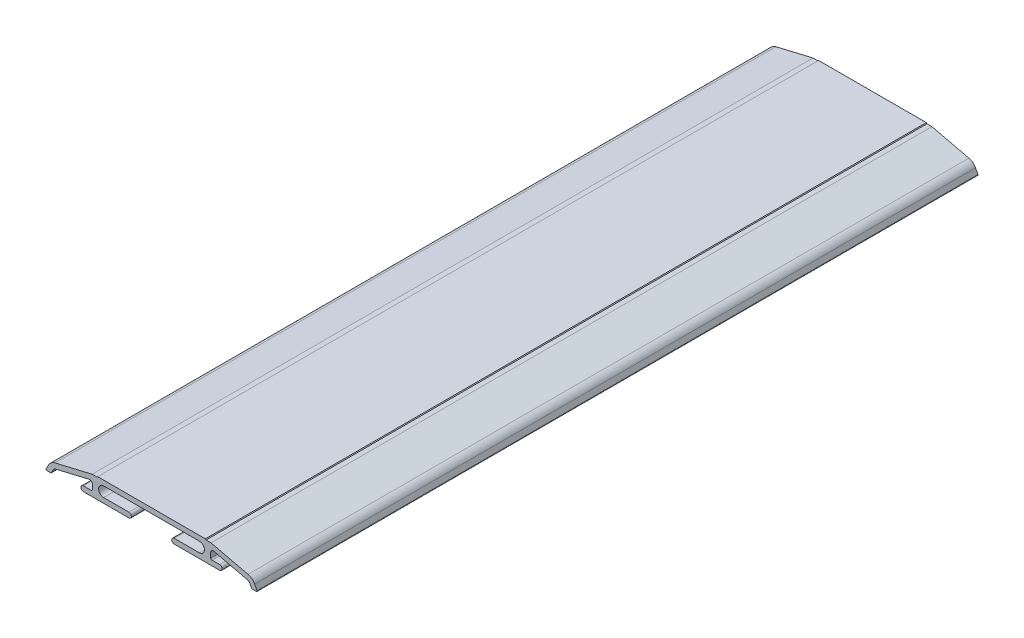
from build123d import *

# Parameters (mm, degrees)
EXTRUDE_1_DEPTH = 286


with BuildPart() as part:
    # Sketch 1 → Extrude 1 (new body)
    with BuildSketch(Plane.XY):
        with BuildLine():
            Line((41.28405549, 54.33971025), (40.342649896, 56.128604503))
            ThreePointArc((40.342649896, 56.128604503), (39.252751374, 57.427783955), (37.722527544, 58.158647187))
            Line((37.722527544, 58.158647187), (23.028357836, 61.63))
            Line((23.028357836, 61.63), (21.065453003, 61.63))
            Line((21.065453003, 61.63), (20.79545302, 61.9))
            Line((20.79545302, 61.9), (-21.90454699, 61.9))
            Line((-21.90454699, 61.9), (-22.17454699, 61.63))
            Line((-22.17454699, 61.63), (-24.137451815, 61.63))
            Line((-24.137451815, 61.63), (-38.831621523, 58.158647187))
            ThreePointArc((-38.831621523, 58.158647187), (-40.361845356, 57.427783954), (-41.45174388, 56.128604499))
            Line((-41.45174388, 56.128604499), (-42.393149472, 54.33971025))
            ThreePointArc((-42.393149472, 54.33971025), (-42.384486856, 54.04494045), (-42.127666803, 53.899999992))
            Line((-42.127666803, 53.899999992), (-40.545642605, 53.899999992))
            ThreePointArc((-40.545642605, 53.899999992), (-40.390583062, 53.943179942), (-40.280159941, 54.060289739))
            Line((-40.280159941, 54.060289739), (-39.68185943, 55.197202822))
            ThreePointArc((-39.68185943, 55.197202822), (-39.136910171, 55.846792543), (-38.371798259, 56.212224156))
            Line((-38.371798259, 56.212224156), (-25.254458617, 59.311066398))
            ThreePointArc((-25.254458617, 59.311066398), (-24.404027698, 59.122046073), (-24.024546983, 58.337854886))
            Line((-24.024546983, 58.337854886), (-24.024546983, 56.399999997))
            ThreePointArc((-24.024546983, 56.399999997), (-24.170993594, 56.046446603), (-24.524546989, 55.899999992))
            Line((-24.524546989, 55.899999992), (-27.554546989, 55.899999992))
            ThreePointArc((-27.554546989, 55.899999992), (-28.554546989, 54.899999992), (-27.554546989, 53.899999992))
            Line((-27.554546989, 53.899999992), (-9.554546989, 53.899999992))
            ThreePointArc((-9.554546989, 53.899999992), (-8.554546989, 54.899999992), (-9.554546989, 55.899999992))
            Line((-9.554546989, 55.899999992), (-19.554546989, 55.899999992))
            ThreePointArc((-19.554546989, 55.899999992), (-21.554546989, 57.899999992), (-19.554546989, 59.899999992))
            Line((-19.554546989, 59.899999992), (18.445453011, 59.899999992))
            ThreePointArc((18.445453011, 59.899999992), (20.445453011, 57.899999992), (18.445453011, 55.899999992))
            Line((18.445453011, 55.899999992), (8.445453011, 55.899999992))
            ThreePointArc((8.445453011, 55.899999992), (7.445453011, 54.899999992), (8.445453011, 53.899999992))
            Line((8.445453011, 53.899999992), (26.445453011, 53.899999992))
            ThreePointArc((26.445453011, 53.899999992), (27.445453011, 54.899999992), (26.445453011, 55.899999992))
            Line((26.445453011, 55.899999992), (23.415453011, 55.899999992))
            ThreePointArc((23.415453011, 55.899999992), (23.061899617, 56.046446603), (22.915453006, 56.399999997))
            Line((22.915453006, 56.399999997), (22.915453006, 58.337854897))
            ThreePointArc((22.915453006, 58.337854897), (23.29493372, 59.122046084), (24.14536464, 59.311066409))
            Line((24.14536464, 59.311066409), (37.262704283, 56.212224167))
            ThreePointArc((37.262704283, 56.212224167), (38.027816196, 55.846792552), (38.572765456, 55.19720283))
            Line((38.572765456, 55.19720283), (39.17106597, 54.060289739))
            ThreePointArc((39.17106597, 54.060289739), (39.281489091, 53.943179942), (39.436548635, 53.899999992))
            Line((39.436548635, 53.899999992), (41.018572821, 53.899999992))
            ThreePointArc((41.018572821, 53.899999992), (41.275392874, 54.04494045), (41.28405549, 54.33971025))
        make_face()
    extrude(amount=-EXTRUDE_1_DEPTH)


solid = part.part
